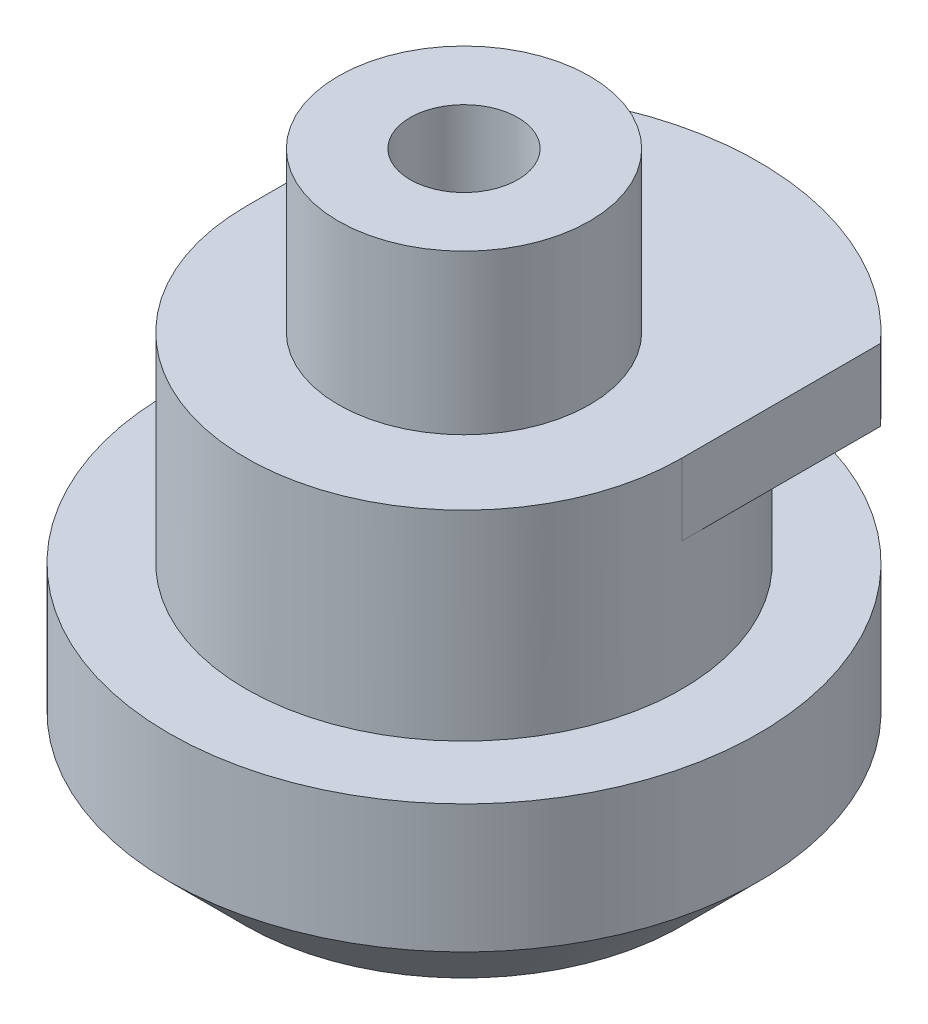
ISO-10303-21;
HEADER;
FILE_DESCRIPTION(('STEP AP214'),'2;1');
FILE_NAME('part.step','',(''),(''),'','','');
FILE_SCHEMA(('AUTOMOTIVE_DESIGN { 1 0 10303 214 1 1 1 1 }'));
ENDSEC;
DATA;
#1=APPLICATION_CONTEXT('core data for automotive mechanical design processes');
#2=APPLICATION_PROTOCOL_DEFINITION('international standard','automotive_design',2000,#1);
#3=PRODUCT_CONTEXT('',#1,'mechanical');
#4=PRODUCT('Part','Part','',(#3));
#5=PRODUCT_RELATED_PRODUCT_CATEGORY('part','',(#4));
#6=PRODUCT_DEFINITION_FORMATION('','',#4);
#7=PRODUCT_DEFINITION_CONTEXT('part definition',#1,'design');
#8=PRODUCT_DEFINITION('design','',#6,#7);
#9=PRODUCT_DEFINITION_SHAPE('','',#8);
#10=(LENGTH_UNIT() NAMED_UNIT(*) SI_UNIT(.MILLI.,.METRE.));
#11=(NAMED_UNIT(*) PLANE_ANGLE_UNIT() SI_UNIT($,.RADIAN.));
#12=(NAMED_UNIT(*) SI_UNIT($,.STERADIAN.) SOLID_ANGLE_UNIT());
#13=UNCERTAINTY_MEASURE_WITH_UNIT(LENGTH_MEASURE(1.E-05),#10,'distance_accuracy_value','');
#14=(GEOMETRIC_REPRESENTATION_CONTEXT(3) GLOBAL_UNCERTAINTY_ASSIGNED_CONTEXT((#13)) GLOBAL_UNIT_ASSIGNED_CONTEXT((#10,
#11,#12)) REPRESENTATION_CONTEXT('',''));
#15=CARTESIAN_POINT('',(0.,0.,0.));
#16=DIRECTION('',(0.,0.,1.));
#17=DIRECTION('',(1.,0.,0.));
#18=AXIS2_PLACEMENT_3D('',#15,#16,#17);
#19=CARTESIAN_POINT('',(0.,15.8,0.));
#20=DIRECTION('',(0.,1.,0.));
#21=DIRECTION('',(0.,0.,1.));
#22=AXIS2_PLACEMENT_3D('',#19,#20,#21);
#23=PLANE('',#22);
#24=CARTESIAN_POINT('',(0.,15.8,0.));
#25=DIRECTION('',(0.,1.,0.));
#26=DIRECTION('',(0.,0.,1.));
#27=AXIS2_PLACEMENT_3D('',#24,#25,#26);
#28=CIRCLE('',#27,8.5);
#29=CARTESIAN_POINT('',(-8.5,15.8,0.));
#30=VERTEX_POINT('',#29);
#31=CARTESIAN_POINT('',(8.5,15.8,0.));
#32=VERTEX_POINT('',#31);
#33=EDGE_CURVE('E119',#30,#32,#28,.T.);
#34=ORIENTED_EDGE('',*,*,#33,.T.);
#35=DIRECTION('',(0.,0.,-1.));
#36=VECTOR('',#35,1.);
#37=CARTESIAN_POINT('',(8.5,15.8,0.));
#38=LINE('',#37,#36);
#39=CARTESIAN_POINT('',(8.5,15.8,-7.74596669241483));
#40=VERTEX_POINT('',#39);
#41=EDGE_CURVE('E95',#32,#40,#38,.T.);
#42=ORIENTED_EDGE('',*,*,#41,.T.);
#43=CARTESIAN_POINT('',(0.,15.8,0.));
#44=DIRECTION('',(0.,1.,0.));
#45=DIRECTION('',(0.,0.,1.));
#46=AXIS2_PLACEMENT_3D('',#43,#44,#45);
#47=CIRCLE('',#46,11.5);
#48=CARTESIAN_POINT('',(-8.5,15.8,-7.74596669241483));
#49=VERTEX_POINT('',#48);
#50=EDGE_CURVE('E83',#40,#49,#47,.T.);
#51=ORIENTED_EDGE('',*,*,#50,.T.);
#52=DIRECTION('',(0.,0.,1.));
#53=VECTOR('',#52,1.);
#54=CARTESIAN_POINT('',(-8.5,15.8,0.));
#55=LINE('',#54,#53);
#56=EDGE_CURVE('E46',#49,#30,#55,.T.);
#57=ORIENTED_EDGE('',*,*,#56,.T.);
#58=EDGE_LOOP('',(#34,#42,#51,#57));
#59=FACE_BOUND('',#58,.T.);
#60=CARTESIAN_POINT('',(0.,15.8,0.));
#61=DIRECTION('',(0.,1.,0.));
#62=DIRECTION('',(0.,0.,1.));
#63=AXIS2_PLACEMENT_3D('',#60,#61,#62);
#64=CIRCLE('',#63,4.9);
#65=CARTESIAN_POINT('',(0.,15.8,-4.9));
#66=VERTEX_POINT('',#65);
#67=EDGE_CURVE('E109',#66,#66,#64,.T.);
#68=ORIENTED_EDGE('',*,*,#67,.F.);
#69=EDGE_LOOP('',(#68));
#70=FACE_BOUND('',#69,.T.);
#71=ADVANCED_FACE('F31',(#59,#70),#23,.T.);
#72=CARTESIAN_POINT('',(0.,8.,0.));
#73=DIRECTION('',(0.,1.,0.));
#74=DIRECTION('',(0.,0.,1.));
#75=AXIS2_PLACEMENT_3D('',#72,#73,#74);
#76=PLANE('',#75);
#77=CARTESIAN_POINT('',(0.,8.,0.));
#78=DIRECTION('',(0.,1.,0.));
#79=DIRECTION('',(0.,0.,1.));
#80=AXIS2_PLACEMENT_3D('',#77,#78,#79);
#81=CIRCLE('',#80,11.5);
#82=CARTESIAN_POINT('',(0.,8.,11.5));
#83=VERTEX_POINT('',#82);
#84=EDGE_CURVE('E121',#83,#83,#81,.T.);
#85=ORIENTED_EDGE('',*,*,#84,.T.);
#86=EDGE_LOOP('',(#85));
#87=FACE_BOUND('',#86,.T.);
#88=CARTESIAN_POINT('',(0.,8.,0.));
#89=DIRECTION('',(0.,1.,0.));
#90=DIRECTION('',(0.,0.,1.));
#91=AXIS2_PLACEMENT_3D('',#88,#89,#90);
#92=CIRCLE('',#91,8.5);
#93=CARTESIAN_POINT('',(0.,8.,8.5));
#94=VERTEX_POINT('',#93);
#95=EDGE_CURVE('E116',#94,#94,#92,.T.);
#96=ORIENTED_EDGE('',*,*,#95,.F.);
#97=EDGE_LOOP('',(#96));
#98=FACE_BOUND('',#97,.T.);
#99=ADVANCED_FACE('F163',(#87,#98),#76,.T.);
#100=CARTESIAN_POINT('',(0.,8.,0.));
#101=DIRECTION('',(0.,-1.,0.));
#102=DIRECTION('',(0.,0.,-1.));
#103=AXIS2_PLACEMENT_3D('',#100,#101,#102);
#104=CYLINDRICAL_SURFACE('',#103,11.5);
#105=CARTESIAN_POINT('',(0.,3.,0.));
#106=DIRECTION('',(0.,1.,0.));
#107=DIRECTION('',(0.,0.,1.));
#108=AXIS2_PLACEMENT_3D('',#105,#106,#107);
#109=CIRCLE('',#108,11.5);
#110=CARTESIAN_POINT('',(0.,3.,11.5));
#111=VERTEX_POINT('',#110);
#112=EDGE_CURVE('E126',#111,#111,#109,.T.);
#113=ORIENTED_EDGE('',*,*,#112,.T.);
#114=EDGE_LOOP('',(#113));
#115=FACE_BOUND('',#114,.T.);
#116=ORIENTED_EDGE('',*,*,#84,.F.);
#117=EDGE_LOOP('',(#116));
#118=FACE_BOUND('',#117,.T.);
#119=ADVANCED_FACE('F152',(#115,#118),#104,.T.);
#120=CARTESIAN_POINT('',(0.,0.,0.));
#121=DIRECTION('',(0.,1.,0.));
#122=DIRECTION('',(0.,0.,1.));
#123=AXIS2_PLACEMENT_3D('',#120,#121,#122);
#124=PLANE('',#123);
#125=CARTESIAN_POINT('',(0.,0.,0.));
#126=DIRECTION('',(0.,-1.,0.));
#127=DIRECTION('',(0.,0.,-1.));
#128=AXIS2_PLACEMENT_3D('',#125,#126,#127);
#129=CIRCLE('',#128,2.5);
#130=CARTESIAN_POINT('',(0.,0.,-2.5));
#131=VERTEX_POINT('',#130);
#132=EDGE_CURVE('E110',#131,#131,#129,.T.);
#133=ORIENTED_EDGE('',*,*,#132,.F.);
#134=EDGE_LOOP('',(#133));
#135=FACE_BOUND('',#134,.T.);
#136=CARTESIAN_POINT('',(0.,0.,0.));
#137=DIRECTION('',(0.,1.,0.));
#138=DIRECTION('',(0.,0.,1.));
#139=AXIS2_PLACEMENT_3D('',#136,#137,#138);
#140=CIRCLE('',#139,8.49999999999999);
#141=CARTESIAN_POINT('',(0.,0.,8.49999999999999));
#142=VERTEX_POINT('',#141);
#143=EDGE_CURVE('E39',#142,#142,#140,.F.);
#144=ORIENTED_EDGE('',*,*,#143,.T.);
#145=EDGE_LOOP('',(#144));
#146=FACE_BOUND('',#145,.T.);
#147=ADVANCED_FACE('F149',(#135,#146),#124,.F.);
#148=CARTESIAN_POINT('',(0.,3.,0.));
#149=DIRECTION('',(0.,1.,0.));
#150=DIRECTION('',(0.,0.,1.));
#151=AXIS2_PLACEMENT_3D('',#148,#149,#150);
#152=CONICAL_SURFACE('',#151,11.5,0.78539816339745);
#153=ORIENTED_EDGE('',*,*,#143,.F.);
#154=EDGE_LOOP('',(#153));
#155=FACE_BOUND('',#154,.T.);
#156=ORIENTED_EDGE('',*,*,#112,.F.);
#157=EDGE_LOOP('',(#156));
#158=FACE_BOUND('',#157,.T.);
#159=ADVANCED_FACE('F33',(#155,#158),#152,.T.);
#160=CARTESIAN_POINT('',(0.,15.8,0.));
#161=DIRECTION('',(0.,-1.,0.));
#162=DIRECTION('',(0.,0.,-1.));
#163=AXIS2_PLACEMENT_3D('',#160,#161,#162);
#164=CYLINDRICAL_SURFACE('',#163,8.5);
#165=ORIENTED_EDGE('',*,*,#33,.F.);
#166=DIRECTION('',(0.,1.,0.));
#167=VECTOR('',#166,1.);
#168=CARTESIAN_POINT('',(-8.5,13.,0.));
#169=LINE('',#168,#167);
#170=CARTESIAN_POINT('',(-8.5,13.,0.));
#171=VERTEX_POINT('',#170);
#172=EDGE_CURVE('E98',#171,#30,#169,.T.);
#173=ORIENTED_EDGE('',*,*,#172,.F.);
#174=CARTESIAN_POINT('',(0.,13.,0.));
#175=DIRECTION('',(0.,1.,0.));
#176=DIRECTION('',(0.,0.,1.));
#177=AXIS2_PLACEMENT_3D('',#174,#175,#176);
#178=CIRCLE('',#177,8.5);
#179=CARTESIAN_POINT('',(8.5,13.,0.));
#180=VERTEX_POINT('',#179);
#181=EDGE_CURVE('E11',#180,#171,#178,.T.);
#182=ORIENTED_EDGE('',*,*,#181,.F.);
#183=DIRECTION('',(0.,1.,0.));
#184=VECTOR('',#183,1.);
#185=CARTESIAN_POINT('',(8.5,13.,0.));
#186=LINE('',#185,#184);
#187=EDGE_CURVE('E77',#180,#32,#186,.T.);
#188=ORIENTED_EDGE('',*,*,#187,.T.);
#189=EDGE_LOOP('',(#165,#173,#182,#188));
#190=FACE_BOUND('',#189,.T.);
#191=ORIENTED_EDGE('',*,*,#95,.T.);
#192=EDGE_LOOP('',(#191));
#193=FACE_BOUND('',#192,.T.);
#194=ADVANCED_FACE('F158',(#190,#193),#164,.T.);
#195=CARTESIAN_POINT('',(0.,22.,0.));
#196=DIRECTION('',(0.,-1.,0.));
#197=DIRECTION('',(0.,0.,-1.));
#198=AXIS2_PLACEMENT_3D('',#195,#196,#197);
#199=CYLINDRICAL_SURFACE('',#198,4.9);
#200=CARTESIAN_POINT('',(0.,22.,0.));
#201=DIRECTION('',(0.,1.,0.));
#202=DIRECTION('',(0.,0.,1.));
#203=AXIS2_PLACEMENT_3D('',#200,#201,#202);
#204=CIRCLE('',#203,4.9);
#205=CARTESIAN_POINT('',(0.,22.,-4.9));
#206=VERTEX_POINT('',#205);
#207=EDGE_CURVE('E113',#206,#206,#204,.T.);
#208=CARTESIAN_POINT('',(0.,22.,-4.9));
#209=CARTESIAN_POINT('',(0.,21.9354166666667,-4.9));
#210=CARTESIAN_POINT('',(0.,21.8708333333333,-4.9));
#211=CARTESIAN_POINT('',(0.,21.7416666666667,-4.9));
#212=CARTESIAN_POINT('',(0.,21.6770833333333,-4.9));
#213=CARTESIAN_POINT('',(0.,21.5479166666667,-4.9));
#214=CARTESIAN_POINT('',(0.,21.4833333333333,-4.9));
#215=CARTESIAN_POINT('',(0.,21.3541666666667,-4.9));
#216=CARTESIAN_POINT('',(0.,21.2895833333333,-4.9));
#217=CARTESIAN_POINT('',(0.,21.1604166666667,-4.9));
#218=CARTESIAN_POINT('',(0.,21.0958333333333,-4.9));
#219=CARTESIAN_POINT('',(0.,20.9666666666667,-4.9));
#220=CARTESIAN_POINT('',(0.,20.9020833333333,-4.9));
#221=CARTESIAN_POINT('',(0.,20.7729166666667,-4.9));
#222=CARTESIAN_POINT('',(0.,20.7083333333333,-4.9));
#223=CARTESIAN_POINT('',(0.,20.5791666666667,-4.9));
#224=CARTESIAN_POINT('',(0.,20.5145833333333,-4.9));
#225=CARTESIAN_POINT('',(0.,20.3854166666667,-4.9));
#226=CARTESIAN_POINT('',(0.,20.3208333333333,-4.9));
#227=CARTESIAN_POINT('',(0.,20.1916666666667,-4.9));
#228=CARTESIAN_POINT('',(0.,20.1270833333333,-4.9));
#229=CARTESIAN_POINT('',(0.,19.9979166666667,-4.9));
#230=CARTESIAN_POINT('',(0.,19.9333333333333,-4.9));
#231=CARTESIAN_POINT('',(0.,19.8041666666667,-4.9));
#232=CARTESIAN_POINT('',(0.,19.7395833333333,-4.9));
#233=CARTESIAN_POINT('',(0.,19.6104166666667,-4.9));
#234=CARTESIAN_POINT('',(0.,19.5458333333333,-4.9));
#235=CARTESIAN_POINT('',(0.,19.4166666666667,-4.9));
#236=CARTESIAN_POINT('',(0.,19.3520833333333,-4.9));
#237=CARTESIAN_POINT('',(0.,19.2229166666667,-4.9));
#238=CARTESIAN_POINT('',(0.,19.1583333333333,-4.9));
#239=CARTESIAN_POINT('',(0.,19.0291666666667,-4.9));
#240=CARTESIAN_POINT('',(0.,18.9645833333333,-4.9));
#241=CARTESIAN_POINT('',(0.,18.8354166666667,-4.9));
#242=CARTESIAN_POINT('',(0.,18.7708333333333,-4.9));
#243=CARTESIAN_POINT('',(0.,18.6416666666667,-4.9));
#244=CARTESIAN_POINT('',(0.,18.5770833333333,-4.9));
#245=CARTESIAN_POINT('',(0.,18.4479166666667,-4.9));
#246=CARTESIAN_POINT('',(0.,18.3833333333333,-4.9));
#247=CARTESIAN_POINT('',(0.,18.2541666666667,-4.9));
#248=CARTESIAN_POINT('',(0.,18.1895833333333,-4.9));
#249=CARTESIAN_POINT('',(0.,18.0604166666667,-4.9));
#250=CARTESIAN_POINT('',(0.,17.9958333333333,-4.9));
#251=CARTESIAN_POINT('',(0.,17.8666666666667,-4.9));
#252=CARTESIAN_POINT('',(0.,17.8020833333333,-4.9));
#253=CARTESIAN_POINT('',(0.,17.6729166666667,-4.9));
#254=CARTESIAN_POINT('',(0.,17.6083333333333,-4.9));
#255=CARTESIAN_POINT('',(0.,17.4791666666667,-4.9));
#256=CARTESIAN_POINT('',(0.,17.4145833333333,-4.9));
#257=CARTESIAN_POINT('',(0.,17.2854166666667,-4.9));
#258=CARTESIAN_POINT('',(0.,17.2208333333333,-4.9));
#259=CARTESIAN_POINT('',(0.,17.0916666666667,-4.9));
#260=CARTESIAN_POINT('',(0.,17.0270833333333,-4.9));
#261=CARTESIAN_POINT('',(0.,16.8979166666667,-4.9));
#262=CARTESIAN_POINT('',(0.,16.8333333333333,-4.9));
#263=CARTESIAN_POINT('',(0.,16.7041666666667,-4.9));
#264=CARTESIAN_POINT('',(0.,16.6395833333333,-4.9));
#265=CARTESIAN_POINT('',(0.,16.5104166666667,-4.9));
#266=CARTESIAN_POINT('',(0.,16.4458333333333,-4.9));
#267=CARTESIAN_POINT('',(0.,16.3166666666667,-4.9));
#268=CARTESIAN_POINT('',(0.,16.2520833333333,-4.9));
#269=CARTESIAN_POINT('',(0.,16.1229166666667,-4.9));
#270=CARTESIAN_POINT('',(0.,16.0583333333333,-4.9));
#271=CARTESIAN_POINT('',(0.,15.9291666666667,-4.9));
#272=CARTESIAN_POINT('',(0.,15.8645833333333,-4.9));
#273=CARTESIAN_POINT('',(0.,15.8,-4.9));
#274=B_SPLINE_CURVE_WITH_KNOTS('',3,(#208,#209,#210,#211,#212,#213,#214,#215,#216,#217,#218,
#219,#220,#221,#222,#223,#224,#225,#226,#227,#228,#229,#230,#231,#232,#233,#234,#235,#236,#237,
#238,#239,#240,#241,#242,#243,#244,#245,#246,#247,#248,#249,#250,#251,#252,#253,#254,#255,#256,
#257,#258,#259,#260,#261,#262,#263,#264,#265,#266,#267,#268,#269,#270,#271,#272,#273),
.UNSPECIFIED.,.F.,.F.,(4,2,2,2,2,2,2,2,2,2,2,2,2,2,2,2,2,2,2,2,2,2,2,2,2,2,2,2,2,2,2,2,4),(0.,
0.193749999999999,0.387499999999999,0.581249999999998,0.774999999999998,0.968749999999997,
1.1625,1.35625,1.55,1.74375,1.9375,2.13125,2.325,2.51875,2.7125,2.90625,3.1,3.29375,3.4875,
3.68125,3.875,4.06875,4.2625,4.45625,4.65,4.84375,5.0375,5.23125,5.425,5.61875,5.8125,6.00625,
6.2),.UNSPECIFIED.);
#275=EDGE_CURVE('BSEAM172',#206,#66,#274,.T.);
#276=ORIENTED_EDGE('',*,*,#207,.F.);
#277=ORIENTED_EDGE('',*,*,#67,.T.);
#278=ORIENTED_EDGE('',*,*,#275,.T.);
#279=ORIENTED_EDGE('',*,*,#275,.F.);
#280=EDGE_LOOP('',(#276,#278,#277,#279));
#281=FACE_BOUND('',#280,.T.);
#282=ADVANCED_FACE('F172',(#281),#199,.T.);
#283=CARTESIAN_POINT('',(0.,22.,0.));
#284=DIRECTION('',(0.,1.,0.));
#285=DIRECTION('',(0.,0.,1.));
#286=AXIS2_PLACEMENT_3D('',#283,#284,#285);
#287=PLANE('',#286);
#288=CARTESIAN_POINT('',(0.,22.,0.));
#289=DIRECTION('',(0.,1.,0.));
#290=DIRECTION('',(0.,0.,1.));
#291=AXIS2_PLACEMENT_3D('',#288,#289,#290);
#292=CIRCLE('',#291,2.1);
#293=CARTESIAN_POINT('',(0.,22.,2.1));
#294=VERTEX_POINT('',#293);
#295=EDGE_CURVE('E100',#294,#294,#292,.T.);
#296=ORIENTED_EDGE('',*,*,#295,.F.);
#297=EDGE_LOOP('',(#296));
#298=FACE_BOUND('',#297,.T.);
#299=ORIENTED_EDGE('',*,*,#207,.T.);
#300=EDGE_LOOP('',(#299));
#301=FACE_BOUND('',#300,.T.);
#302=ADVANCED_FACE('F145',(#298,#301),#287,.T.);
#303=CARTESIAN_POINT('',(0.,13.5,0.));
#304=DIRECTION('',(0.,-1.,0.));
#305=DIRECTION('',(0.,0.,-1.));
#306=AXIS2_PLACEMENT_3D('',#303,#304,#305);
#307=CYLINDRICAL_SURFACE('',#306,2.5);
#308=CARTESIAN_POINT('',(0.,13.5,0.));
#309=DIRECTION('',(0.,-1.,0.));
#310=DIRECTION('',(0.,0.,-1.));
#311=AXIS2_PLACEMENT_3D('',#308,#309,#310);
#312=CIRCLE('',#311,2.5);
#313=CARTESIAN_POINT('',(0.,13.5,-2.5));
#314=VERTEX_POINT('',#313);
#315=EDGE_CURVE('E106',#314,#314,#312,.T.);
#316=ORIENTED_EDGE('',*,*,#315,.F.);
#317=EDGE_LOOP('',(#316));
#318=FACE_BOUND('',#317,.T.);
#319=ORIENTED_EDGE('',*,*,#132,.T.);
#320=EDGE_LOOP('',(#319));
#321=FACE_BOUND('',#320,.T.);
#322=ADVANCED_FACE('F139',(#318,#321),#307,.F.);
#323=CARTESIAN_POINT('',(0.,13.5,0.));
#324=DIRECTION('',(0.,-1.,0.));
#325=DIRECTION('',(0.,0.,-1.));
#326=AXIS2_PLACEMENT_3D('',#323,#324,#325);
#327=PLANE('',#326);
#328=CARTESIAN_POINT('',(0.,13.5,0.));
#329=DIRECTION('',(0.,-1.,0.));
#330=DIRECTION('',(0.,0.,-1.));
#331=AXIS2_PLACEMENT_3D('',#328,#329,#330);
#332=CIRCLE('',#331,2.1);
#333=CARTESIAN_POINT('',(0.,13.5,-2.1));
#334=VERTEX_POINT('',#333);
#335=EDGE_CURVE('E105',#334,#334,#332,.T.);
#336=ORIENTED_EDGE('',*,*,#335,.F.);
#337=EDGE_LOOP('',(#336));
#338=FACE_BOUND('',#337,.T.);
#339=ORIENTED_EDGE('',*,*,#315,.T.);
#340=EDGE_LOOP('',(#339));
#341=FACE_BOUND('',#340,.T.);
#342=ADVANCED_FACE('F136',(#338,#341),#327,.T.);
#343=CARTESIAN_POINT('',(0.,0.,0.));
#344=DIRECTION('',(0.,1.,0.));
#345=DIRECTION('',(0.,0.,1.));
#346=AXIS2_PLACEMENT_3D('',#343,#344,#345);
#347=CYLINDRICAL_SURFACE('',#346,2.1);
#348=ORIENTED_EDGE('',*,*,#335,.T.);
#349=EDGE_LOOP('',(#348));
#350=FACE_BOUND('',#349,.T.);
#351=ORIENTED_EDGE('',*,*,#295,.T.);
#352=EDGE_LOOP('',(#351));
#353=FACE_BOUND('',#352,.T.);
#354=ADVANCED_FACE('F133',(#350,#353),#347,.F.);
#355=CARTESIAN_POINT('',(0.,13.,0.));
#356=DIRECTION('',(0.,1.,0.));
#357=DIRECTION('',(0.,0.,1.));
#358=AXIS2_PLACEMENT_3D('',#355,#356,#357);
#359=PLANE('',#358);
#360=DIRECTION('',(0.,0.,-1.));
#361=VECTOR('',#360,1.);
#362=CARTESIAN_POINT('',(8.5,13.,0.));
#363=LINE('',#362,#361);
#364=CARTESIAN_POINT('',(8.5,13.,-7.74596669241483));
#365=VERTEX_POINT('',#364);
#366=EDGE_CURVE('E87',#180,#365,#363,.T.);
#367=ORIENTED_EDGE('',*,*,#366,.F.);
#368=ORIENTED_EDGE('',*,*,#181,.T.);
#369=DIRECTION('',(0.,0.,1.));
#370=VECTOR('',#369,1.);
#371=CARTESIAN_POINT('',(-8.5,13.,0.));
#372=LINE('',#371,#370);
#373=CARTESIAN_POINT('',(-8.5,13.,-7.74596669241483));
#374=VERTEX_POINT('',#373);
#375=EDGE_CURVE('E88',#374,#171,#372,.T.);
#376=ORIENTED_EDGE('',*,*,#375,.F.);
#377=CARTESIAN_POINT('',(0.,13.,0.));
#378=DIRECTION('',(0.,1.,0.));
#379=DIRECTION('',(0.,0.,1.));
#380=AXIS2_PLACEMENT_3D('',#377,#378,#379);
#381=CIRCLE('',#380,11.5);
#382=EDGE_CURVE('E82',#365,#374,#381,.T.);
#383=ORIENTED_EDGE('',*,*,#382,.F.);
#384=EDGE_LOOP('',(#367,#368,#376,#383));
#385=FACE_BOUND('',#384,.T.);
#386=ADVANCED_FACE('F86',(#385),#359,.F.);
#387=CARTESIAN_POINT('',(-8.5,13.,0.));
#388=DIRECTION('',(-1.,0.,0.));
#389=DIRECTION('',(0.,0.,1.));
#390=AXIS2_PLACEMENT_3D('',#387,#388,#389);
#391=PLANE('',#390);
#392=ORIENTED_EDGE('',*,*,#56,.F.);
#393=DIRECTION('',(0.,1.,0.));
#394=VECTOR('',#393,1.);
#395=CARTESIAN_POINT('',(-8.5,13.,-7.74596669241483));
#396=LINE('',#395,#394);
#397=EDGE_CURVE('E71',#374,#49,#396,.T.);
#398=ORIENTED_EDGE('',*,*,#397,.F.);
#399=ORIENTED_EDGE('',*,*,#375,.T.);
#400=ORIENTED_EDGE('',*,*,#172,.T.);
#401=EDGE_LOOP('',(#392,#398,#399,#400));
#402=FACE_BOUND('',#401,.T.);
#403=ADVANCED_FACE('F196',(#402),#391,.T.);
#404=CARTESIAN_POINT('',(0.,13.,0.));
#405=DIRECTION('',(0.,1.,0.));
#406=DIRECTION('',(0.,0.,1.));
#407=AXIS2_PLACEMENT_3D('',#404,#405,#406);
#408=CYLINDRICAL_SURFACE('',#407,11.5);
#409=ORIENTED_EDGE('',*,*,#50,.F.);
#410=DIRECTION('',(0.,1.,0.));
#411=VECTOR('',#410,1.);
#412=CARTESIAN_POINT('',(8.5,13.,-7.74596669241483));
#413=LINE('',#412,#411);
#414=EDGE_CURVE('E79',#365,#40,#413,.T.);
#415=ORIENTED_EDGE('',*,*,#414,.F.);
#416=ORIENTED_EDGE('',*,*,#382,.T.);
#417=ORIENTED_EDGE('',*,*,#397,.T.);
#418=EDGE_LOOP('',(#409,#415,#416,#417));
#419=FACE_BOUND('',#418,.T.);
#420=ADVANCED_FACE('F81',(#419),#408,.T.);
#421=CARTESIAN_POINT('',(8.5,13.,0.));
#422=DIRECTION('',(1.,0.,0.));
#423=DIRECTION('',(0.,0.,-1.));
#424=AXIS2_PLACEMENT_3D('',#421,#422,#423);
#425=PLANE('',#424);
#426=ORIENTED_EDGE('',*,*,#41,.F.);
#427=ORIENTED_EDGE('',*,*,#187,.F.);
#428=ORIENTED_EDGE('',*,*,#366,.T.);
#429=ORIENTED_EDGE('',*,*,#414,.T.);
#430=EDGE_LOOP('',(#426,#427,#428,#429));
#431=FACE_BOUND('',#430,.T.);
#432=ADVANCED_FACE('F90',(#431),#425,.T.);
#433=CLOSED_SHELL('',(#71,#99,#119,#147,#159,#194,#282,#302,#322,#342,#354,#386,#403,#420,#432));
#434=MANIFOLD_SOLID_BREP('B2',#433);
#435=ADVANCED_BREP_SHAPE_REPRESENTATION('',(#18,#434),#14);
#436=SHAPE_DEFINITION_REPRESENTATION(#9,#435);
ENDSEC;
END-ISO-10303-21;
